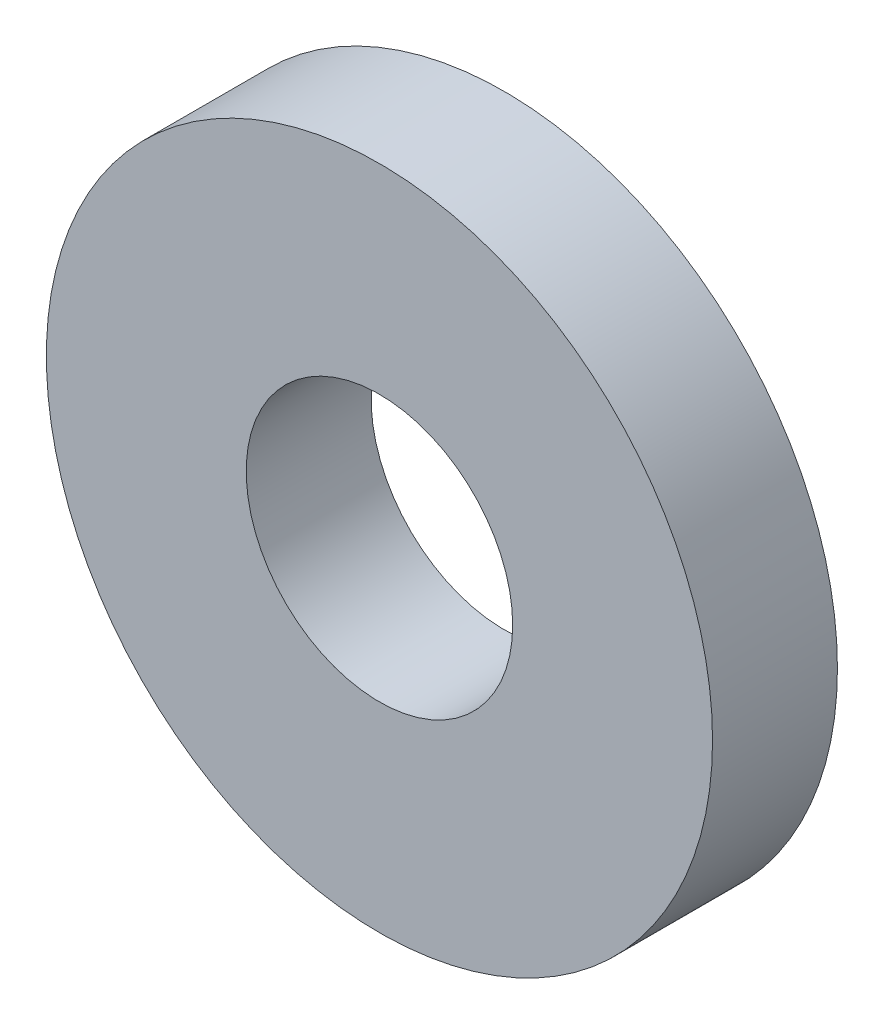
from build123d import *

# Parameters (mm, degrees)
SKETCH1_R           = 4
SKETCH1_R_2         = 1.6
BOSS_EXTRUDE1_DEPTH = 1.5


with BuildPart() as part:
    # Sketch1 → Boss-Extrude1 (new body)
    with BuildSketch(Plane.XY):
        Circle(SKETCH1_R)
        Circle(SKETCH1_R_2, mode=Mode.SUBTRACT)
    extrude(amount=BOSS_EXTRUDE1_DEPTH)


solid = part.part
